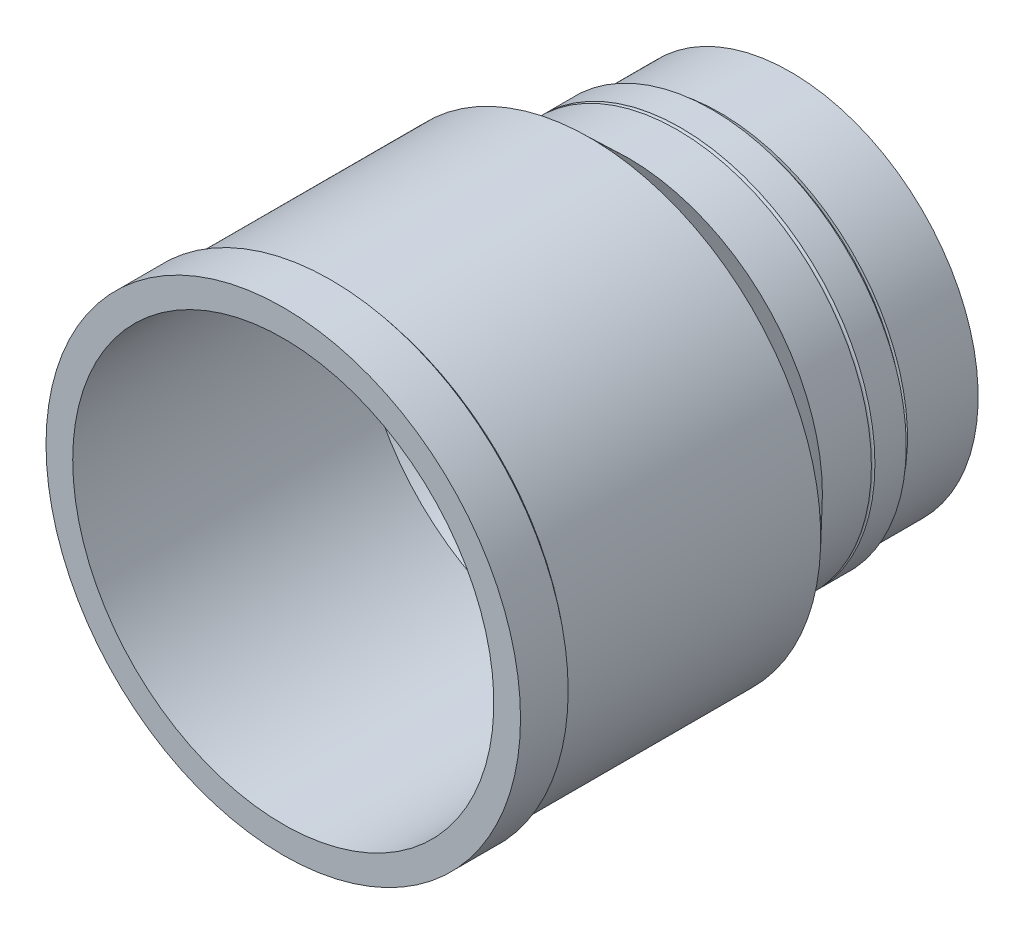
from build123d import *


with BuildPart() as part:
    # Sketch1 → Revolve2 (revolve)
    with BuildSketch(Plane(origin=(0, 0, 0), x_dir=(0, 0, -1), z_dir=(1, 0, 0)), mode=Mode.PRIVATE) as revolve2_sk:
        with BuildLine():
            Line((254, 97.841967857), (254, 84.716465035))
            Line((254, 84.716465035), (228.6, 84.716465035))
            Line((228.6, 84.716465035), (164.594221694, 121.212859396))
            Line((164.594221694, 121.212859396), (0, 121.212859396))
            Line((0, 121.212859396), (0, 136.5885))
            Line((0, 136.5885), (27.432, 136.5885))
            Line((27.432, 136.5885), (30.48, 132.9055))
            Line((30.48, 132.9055), (176.53, 132.9055))
            Line((176.53, 132.9055), (198.628, 111.76))
            Line((198.628, 111.76), (226.822, 111.76))
            ThreePointArc((226.822, 111.76), (227.838, 110.744), (228.854, 111.76))
            Line((228.854, 111.76), (246.888, 111.76))
            Line((246.888, 111.76), (246.888, 106.072401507))
            Line((246.888, 106.072401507), (251.4092, 106.072401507))
            Line((251.4092, 106.072401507), (251.4092, 107.95))
            Line((251.4092, 107.95), (292.1, 107.95))
            Line((292.1, 107.95), (292.1, 97.841967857))
            Line((292.1, 97.841967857), (254, 97.841967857))
        make_face()
    revolve(revolve2_sk.sketch.rotate(Axis((0, 0, -87.913937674), (0, 0, 1)), 90), axis=Axis((0, 0, -87.913937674), (0, 0, 1)))


solid = part.part
